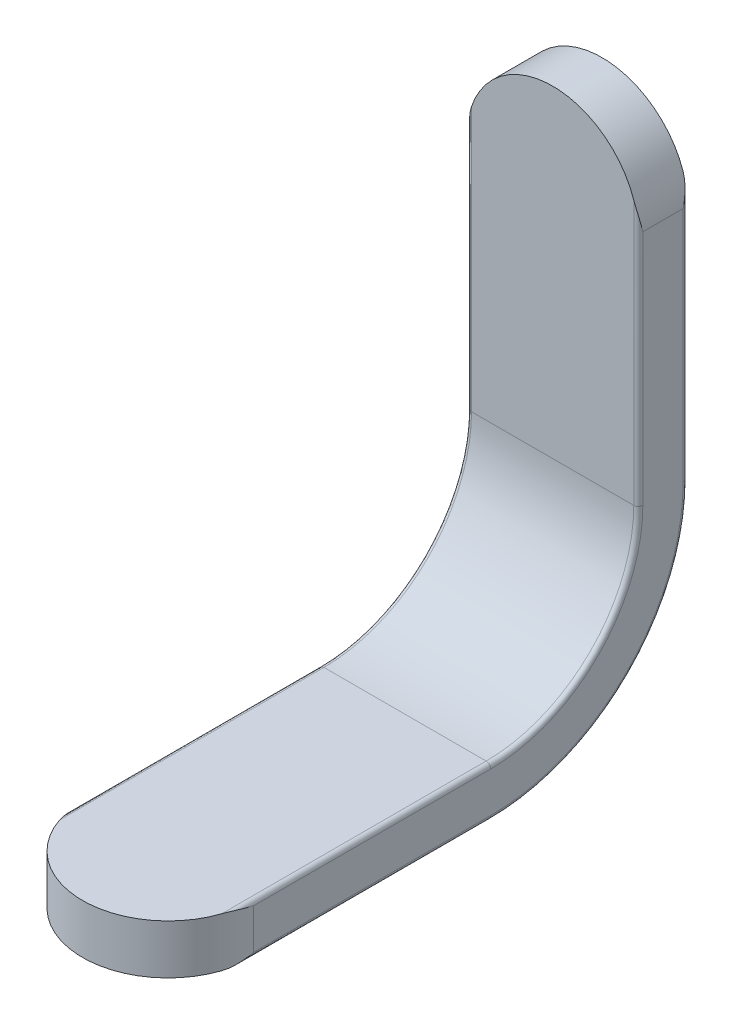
ISO-10303-21;
HEADER;
FILE_DESCRIPTION(('STEP AP214'),'2;1');
FILE_NAME('part.step','',(''),(''),'','','');
FILE_SCHEMA(('AUTOMOTIVE_DESIGN { 1 0 10303 214 1 1 1 1 }'));
ENDSEC;
DATA;
#1=APPLICATION_CONTEXT('core data for automotive mechanical design processes');
#2=APPLICATION_PROTOCOL_DEFINITION('international standard','automotive_design',2000,#1);
#3=PRODUCT_CONTEXT('',#1,'mechanical');
#4=PRODUCT('Part','Part','',(#3));
#5=PRODUCT_RELATED_PRODUCT_CATEGORY('part','',(#4));
#6=PRODUCT_DEFINITION_FORMATION('','',#4);
#7=PRODUCT_DEFINITION_CONTEXT('part definition',#1,'design');
#8=PRODUCT_DEFINITION('design','',#6,#7);
#9=PRODUCT_DEFINITION_SHAPE('','',#8);
#10=(LENGTH_UNIT() NAMED_UNIT(*) SI_UNIT(.MILLI.,.METRE.));
#11=(NAMED_UNIT(*) PLANE_ANGLE_UNIT() SI_UNIT($,.RADIAN.));
#12=(NAMED_UNIT(*) SI_UNIT($,.STERADIAN.) SOLID_ANGLE_UNIT());
#13=UNCERTAINTY_MEASURE_WITH_UNIT(LENGTH_MEASURE(1.E-05),#10,'distance_accuracy_value','');
#14=(GEOMETRIC_REPRESENTATION_CONTEXT(3) GLOBAL_UNCERTAINTY_ASSIGNED_CONTEXT((#13)) GLOBAL_UNIT_ASSIGNED_CONTEXT((#10,
#11,#12)) REPRESENTATION_CONTEXT('',''));
#15=CARTESIAN_POINT('',(0.,0.,0.));
#16=DIRECTION('',(0.,0.,1.));
#17=DIRECTION('',(1.,0.,0.));
#18=AXIS2_PLACEMENT_3D('',#15,#16,#17);
#19=CARTESIAN_POINT('',(0.,152.,0.));
#20=DIRECTION('',(0.,0.,1.));
#21=DIRECTION('',(1.,0.,0.));
#22=AXIS2_PLACEMENT_3D('',#19,#20,#21);
#23=CYLINDRICAL_SURFACE('',#22,30.);
#24=CARTESIAN_POINT('',(28.41,161.637006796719,17.3));
#25=CARTESIAN_POINT('',(28.4528668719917,161.510636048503,17.2999913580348));
#26=CARTESIAN_POINT('',(28.4948856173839,161.38399127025,17.2982675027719));
#27=CARTESIAN_POINT('',(28.5772027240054,161.130239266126,17.2917248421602));
#28=CARTESIAN_POINT('',(28.6175012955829,161.003132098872,17.2869064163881));
#29=CARTESIAN_POINT('',(28.7357392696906,160.621382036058,17.2683205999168));
#30=CARTESIAN_POINT('',(28.8110826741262,160.366128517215,17.2504216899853));
#31=CARTESIAN_POINT('',(28.9546638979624,159.854800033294,17.2056882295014));
#32=CARTESIAN_POINT('',(29.0229107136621,159.598726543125,17.1788651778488));
#33=CARTESIAN_POINT('',(29.1524241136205,159.085633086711,17.1178460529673));
#34=CARTESIAN_POINT('',(29.2136888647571,158.828612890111,17.0836480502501));
#35=CARTESIAN_POINT('',(29.3322213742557,158.300613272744,17.0072406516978));
#36=CARTESIAN_POINT('',(29.3891197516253,158.029597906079,16.9647089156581));
#37=CARTESIAN_POINT('',(29.4952454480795,157.486978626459,16.8741330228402));
#38=CARTESIAN_POINT('',(29.544472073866,157.21537466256,16.8260883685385));
#39=CARTESIAN_POINT('',(29.6807386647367,156.39973999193,16.6752512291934));
#40=CARTESIAN_POINT('',(29.7563413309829,155.854993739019,16.5657719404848));
#41=CARTESIAN_POINT('',(29.8774145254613,154.764308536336,16.335841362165));
#42=CARTESIAN_POINT('',(29.9228705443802,154.218369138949,16.2153848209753));
#43=CARTESIAN_POINT('',(29.9838407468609,153.126170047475,15.9692153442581));
#44=CARTESIAN_POINT('',(29.9993665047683,152.579910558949,15.8435044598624));
#45=CARTESIAN_POINT('',(29.9999936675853,152.022505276,15.7151811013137));
#46=CARTESIAN_POINT('',(29.9999999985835,152.011252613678,15.7125905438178));
#47=CARTESIAN_POINT('',(30.,152.,15.71));
#48=B_SPLINE_CURVE_WITH_KNOTS('',3,(#24,#25,#26,#27,#28,#29,#30,#31,#32,#33,#34,#35,#36,#37,#38,
#39,#40,#41,#42,#43,#44,#45,#46,#47),.UNSPECIFIED.,.F.,.F.,(4,2,2,2,2,2,2,2,2,2,2,4),(0.,
0.400295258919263,0.800541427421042,1.60045769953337,2.39934723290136,3.1984460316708,
4.03877949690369,4.87918885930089,6.56034026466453,8.24230020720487,9.92360958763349,
9.95825060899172),.UNSPECIFIED.);
#49=CARTESIAN_POINT('',(30.,152.,15.71));
#50=VERTEX_POINT('',#49);
#51=CARTESIAN_POINT('',(28.41,161.637006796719,17.3));
#52=VERTEX_POINT('',#51);
#53=EDGE_CURVE('E180',#50,#52,#48,.F.);
#54=ORIENTED_EDGE('',*,*,#53,.F.);
#55=DIRECTION('',(0.,0.,1.));
#56=VECTOR('',#55,1.);
#57=CARTESIAN_POINT('',(30.,152.,0.));
#58=LINE('',#57,#56);
#59=CARTESIAN_POINT('',(30.,152.,1.58999999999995));
#60=VERTEX_POINT('',#59);
#61=EDGE_CURVE('E353',#60,#50,#58,.T.);
#62=ORIENTED_EDGE('',*,*,#61,.F.);
#63=CARTESIAN_POINT('',(28.41,161.637006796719,0.));
#64=CARTESIAN_POINT('',(28.4528668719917,161.510636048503,8.64196513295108E-06));
#65=CARTESIAN_POINT('',(28.494885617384,161.38399127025,0.00173249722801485));
#66=CARTESIAN_POINT('',(28.5772027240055,161.130239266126,0.00827515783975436));
#67=CARTESIAN_POINT('',(28.617501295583,161.003132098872,0.0130935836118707));
#68=CARTESIAN_POINT('',(28.7357392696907,160.621382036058,0.0316794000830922));
#69=CARTESIAN_POINT('',(28.8110826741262,160.366128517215,0.0495783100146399));
#70=CARTESIAN_POINT('',(28.9546638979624,159.854800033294,0.0943117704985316));
#71=CARTESIAN_POINT('',(29.0229107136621,159.598726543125,0.121134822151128));
#72=CARTESIAN_POINT('',(29.1524241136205,159.08563308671,0.182153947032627));
#73=CARTESIAN_POINT('',(29.2136888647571,158.828612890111,0.2163519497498));
#74=CARTESIAN_POINT('',(29.3322213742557,158.300613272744,0.292759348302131));
#75=CARTESIAN_POINT('',(29.3891197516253,158.029597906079,0.33529108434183));
#76=CARTESIAN_POINT('',(29.4952454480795,157.486978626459,0.425866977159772));
#77=CARTESIAN_POINT('',(29.544472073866,157.21537466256,0.473911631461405));
#78=CARTESIAN_POINT('',(29.6807386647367,156.39973999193,0.624748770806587));
#79=CARTESIAN_POINT('',(29.7563413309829,155.854993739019,0.734228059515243));
#80=CARTESIAN_POINT('',(29.8774145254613,154.764308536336,0.964158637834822));
#81=CARTESIAN_POINT('',(29.9228705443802,154.218369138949,1.08461517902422));
#82=CARTESIAN_POINT('',(29.9838407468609,153.126170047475,1.33078465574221));
#83=CARTESIAN_POINT('',(29.9993665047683,152.57991055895,1.45649554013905));
#84=CARTESIAN_POINT('',(29.9999936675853,152.022505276,1.58481889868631));
#85=CARTESIAN_POINT('',(29.9999999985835,152.011252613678,1.58740945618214));
#86=CARTESIAN_POINT('',(30.,152.,1.58999999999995));
#87=B_SPLINE_CURVE_WITH_KNOTS('',3,(#63,#64,#65,#66,#67,#68,#69,#70,#71,#72,#73,#74,#75,#76,#77,
#78,#79,#80,#81,#82,#83,#84,#85,#86),.UNSPECIFIED.,.F.,.F.,(4,2,2,2,2,2,2,2,2,2,2,4),(0.,
0.400295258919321,0.800541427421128,1.60045769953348,2.39934723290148,3.1984460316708,
4.03877949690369,4.87918885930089,6.56034026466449,8.24230020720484,9.92360958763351,
9.95825060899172),.UNSPECIFIED.);
#88=CARTESIAN_POINT('',(28.41,161.637006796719,0.));
#89=VERTEX_POINT('',#88);
#90=EDGE_CURVE('E221',#89,#60,#87,.T.);
#91=ORIENTED_EDGE('',*,*,#90,.F.);
#92=CARTESIAN_POINT('',(0.,152.,0.));
#93=DIRECTION('',(0.,0.,-1.));
#94=DIRECTION('',(1.,0.,0.));
#95=AXIS2_PLACEMENT_3D('',#92,#93,#94);
#96=CIRCLE('',#95,30.);
#97=CARTESIAN_POINT('',(-28.41,161.637006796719,0.));
#98=VERTEX_POINT('',#97);
#99=EDGE_CURVE('E350',#98,#89,#96,.T.);
#100=ORIENTED_EDGE('',*,*,#99,.F.);
#101=CARTESIAN_POINT('',(-28.41,161.637006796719,0.));
#102=CARTESIAN_POINT('',(-28.4528668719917,161.510636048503,8.64196513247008E-06));
#103=CARTESIAN_POINT('',(-28.494885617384,161.38399127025,0.00173249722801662));
#104=CARTESIAN_POINT('',(-28.5772027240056,161.130239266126,0.00827515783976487));
#105=CARTESIAN_POINT('',(-28.6175012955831,161.003132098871,0.0130935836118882));
#106=CARTESIAN_POINT('',(-28.7357392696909,160.621382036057,0.0316794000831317));
#107=CARTESIAN_POINT('',(-28.8110826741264,160.366128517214,0.0495783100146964));
#108=CARTESIAN_POINT('',(-28.9546638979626,159.854800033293,0.0943117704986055));
#109=CARTESIAN_POINT('',(-29.0229107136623,159.598726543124,0.121134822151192));
#110=CARTESIAN_POINT('',(-29.1524241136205,159.08563308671,0.182153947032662));
#111=CARTESIAN_POINT('',(-29.2136888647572,158.828612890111,0.216351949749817));
#112=CARTESIAN_POINT('',(-29.3322213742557,158.300613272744,0.292759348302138));
#113=CARTESIAN_POINT('',(-29.3891197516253,158.029597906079,0.335291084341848));
#114=CARTESIAN_POINT('',(-29.4952454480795,157.486978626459,0.42586697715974));
#115=CARTESIAN_POINT('',(-29.544472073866,157.21537466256,0.47391163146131));
#116=CARTESIAN_POINT('',(-29.6807386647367,156.39973999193,0.624748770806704));
#117=CARTESIAN_POINT('',(-29.7563413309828,155.854993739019,0.734228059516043));
#118=CARTESIAN_POINT('',(-29.8774145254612,154.764308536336,0.964158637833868));
#119=CARTESIAN_POINT('',(-29.9228705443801,154.218369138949,1.08461517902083));
#120=CARTESIAN_POINT('',(-29.9838407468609,153.126170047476,1.33078465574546));
#121=CARTESIAN_POINT('',(-29.9993665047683,152.579910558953,1.45649554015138));
#122=CARTESIAN_POINT('',(-29.9999936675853,152.022505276,1.58481889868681));
#123=CARTESIAN_POINT('',(-29.9999999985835,152.011252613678,1.5874094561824));
#124=CARTESIAN_POINT('',(-30.,152.,1.58999999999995));
#125=B_SPLINE_CURVE_WITH_KNOTS('',3,(#101,#102,#103,#104,#105,#106,#107,#108,#109,#110,#111,
#112,#113,#114,#115,#116,#117,#118,#119,#120,#121,#122,#123,#124),.UNSPECIFIED.,.F.,.F.,(4,2,2,
2,2,2,2,2,2,2,2,4),(0.,0.400295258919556,0.800541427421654,1.60045769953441,2.39934723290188,
3.1984460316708,4.03877949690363,4.87918885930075,6.56034026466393,8.24230020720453,
9.92360958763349,9.95825060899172),.UNSPECIFIED.);
#126=CARTESIAN_POINT('',(-30.,152.,1.58999999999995));
#127=VERTEX_POINT('',#126);
#128=EDGE_CURVE('E213',#127,#98,#125,.F.);
#129=ORIENTED_EDGE('',*,*,#128,.F.);
#130=DIRECTION('',(0.,0.,1.));
#131=VECTOR('',#130,1.);
#132=CARTESIAN_POINT('',(-30.,152.,0.));
#133=LINE('',#132,#131);
#134=CARTESIAN_POINT('',(-30.,152.,15.71));
#135=VERTEX_POINT('',#134);
#136=EDGE_CURVE('E292',#127,#135,#133,.T.);
#137=ORIENTED_EDGE('',*,*,#136,.T.);
#138=CARTESIAN_POINT('',(-28.41,161.637006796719,17.3));
#139=CARTESIAN_POINT('',(-28.4528668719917,161.510636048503,17.2999913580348));
#140=CARTESIAN_POINT('',(-28.494885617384,161.38399127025,17.2982675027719));
#141=CARTESIAN_POINT('',(-28.5772027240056,161.130239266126,17.2917248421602));
#142=CARTESIAN_POINT('',(-28.6175012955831,161.003132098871,17.286906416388));
#143=CARTESIAN_POINT('',(-28.7357392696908,160.621382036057,17.2683205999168));
#144=CARTESIAN_POINT('',(-28.8110826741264,160.366128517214,17.2504216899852));
#145=CARTESIAN_POINT('',(-28.9546638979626,159.854800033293,17.2056882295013));
#146=CARTESIAN_POINT('',(-29.0229107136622,159.598726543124,17.1788651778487));
#147=CARTESIAN_POINT('',(-29.1524241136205,159.08563308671,17.1178460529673));
#148=CARTESIAN_POINT('',(-29.2136888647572,158.828612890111,17.0836480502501));
#149=CARTESIAN_POINT('',(-29.3322213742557,158.300613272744,17.0072406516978));
#150=CARTESIAN_POINT('',(-29.3891197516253,158.029597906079,16.9647089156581));
#151=CARTESIAN_POINT('',(-29.4952454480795,157.486978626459,16.8741330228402));
#152=CARTESIAN_POINT('',(-29.544472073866,157.21537466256,16.8260883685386));
#153=CARTESIAN_POINT('',(-29.6807386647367,156.39973999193,16.6752512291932));
#154=CARTESIAN_POINT('',(-29.7563413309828,155.854993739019,16.565771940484));
#155=CARTESIAN_POINT('',(-29.8774145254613,154.764308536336,16.3358413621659));
#156=CARTESIAN_POINT('',(-29.9228705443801,154.218369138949,16.2153848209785));
#157=CARTESIAN_POINT('',(-29.9838407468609,153.126170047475,15.969215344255));
#158=CARTESIAN_POINT('',(-29.9993665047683,152.579910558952,15.8435044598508));
#159=CARTESIAN_POINT('',(-29.9999936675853,152.022505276,15.7151811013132));
#160=CARTESIAN_POINT('',(-29.9999999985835,152.011252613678,15.7125905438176));
#161=CARTESIAN_POINT('',(-30.,152.,15.71));
#162=B_SPLINE_CURVE_WITH_KNOTS('',3,(#138,#139,#140,#141,#142,#143,#144,#145,#146,#147,#148,
#149,#150,#151,#152,#153,#154,#155,#156,#157,#158,#159,#160,#161),.UNSPECIFIED.,.F.,.F.,(4,2,2,
2,2,2,2,2,2,2,2,4),(0.,0.400295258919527,0.800541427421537,1.60045769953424,2.39934723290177,
3.19844603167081,4.03877949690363,4.87918885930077,6.56034026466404,8.24230020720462,
9.92360958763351,9.95825060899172),.UNSPECIFIED.);
#163=CARTESIAN_POINT('',(-28.41,161.637006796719,17.3));
#164=VERTEX_POINT('',#163);
#165=EDGE_CURVE('E205',#164,#135,#162,.T.);
#166=ORIENTED_EDGE('',*,*,#165,.F.);
#167=CARTESIAN_POINT('',(0.,152.,17.3));
#168=DIRECTION('',(0.,0.,-1.));
#169=DIRECTION('',(1.,0.,0.));
#170=AXIS2_PLACEMENT_3D('',#167,#168,#169);
#171=CIRCLE('',#170,30.);
#172=EDGE_CURVE('E347',#164,#52,#171,.T.);
#173=ORIENTED_EDGE('',*,*,#172,.T.);
#174=EDGE_LOOP('',(#54,#62,#91,#100,#129,#137,#166,#173));
#175=FACE_BOUND('',#174,.T.);
#176=ADVANCED_FACE('F33',(#175),#23,.T.);
#177=CARTESIAN_POINT('',(30.,69.,69.));
#178=DIRECTION('',(-1.,0.,0.));
#179=DIRECTION('',(0.,0.,1.));
#180=AXIS2_PLACEMENT_3D('',#177,#178,#179);
#181=PLANE('',#180);
#182=DIRECTION('',(0.,1.,0.));
#183=VECTOR('',#182,1.);
#184=CARTESIAN_POINT('',(30.,69.,15.71));
#185=LINE('',#184,#183);
#186=CARTESIAN_POINT('',(30.,69.,15.71));
#187=VERTEX_POINT('',#186);
#188=EDGE_CURVE('E170',#187,#50,#185,.T.);
#189=ORIENTED_EDGE('',*,*,#188,.F.);
#190=CARTESIAN_POINT('',(30.,69.,69.));
#191=DIRECTION('',(1.,0.,0.));
#192=DIRECTION('',(0.,0.,-1.));
#193=AXIS2_PLACEMENT_3D('',#190,#191,#192);
#194=CIRCLE('',#193,53.29);
#195=CARTESIAN_POINT('',(30.,15.71,69.));
#196=VERTEX_POINT('',#195);
#197=EDGE_CURVE('E163',#196,#187,#194,.T.);
#198=ORIENTED_EDGE('',*,*,#197,.F.);
#199=DIRECTION('',(0.,0.,1.));
#200=VECTOR('',#199,1.);
#201=CARTESIAN_POINT('',(30.,15.71,69.));
#202=LINE('',#201,#200);
#203=CARTESIAN_POINT('',(30.,15.71,152.));
#204=VERTEX_POINT('',#203);
#205=EDGE_CURVE('E150',#196,#204,#202,.T.);
#206=ORIENTED_EDGE('',*,*,#205,.T.);
#207=DIRECTION('',(0.,1.,0.));
#208=VECTOR('',#207,1.);
#209=CARTESIAN_POINT('',(30.,0.,152.));
#210=LINE('',#209,#208);
#211=CARTESIAN_POINT('',(30.,1.58999999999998,152.));
#212=VERTEX_POINT('',#211);
#213=EDGE_CURVE('E345',#212,#204,#210,.T.);
#214=ORIENTED_EDGE('',*,*,#213,.F.);
#215=DIRECTION('',(0.,0.,1.));
#216=VECTOR('',#215,1.);
#217=CARTESIAN_POINT('',(30.,1.58999999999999,69.));
#218=LINE('',#217,#216);
#219=CARTESIAN_POINT('',(30.,1.58999999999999,69.));
#220=VERTEX_POINT('',#219);
#221=EDGE_CURVE('E60',#220,#212,#218,.T.);
#222=ORIENTED_EDGE('',*,*,#221,.F.);
#223=CARTESIAN_POINT('',(30.,69.,69.));
#224=DIRECTION('',(1.,0.,0.));
#225=DIRECTION('',(0.,0.,-1.));
#226=AXIS2_PLACEMENT_3D('',#223,#224,#225);
#227=CIRCLE('',#226,67.41);
#228=CARTESIAN_POINT('',(30.,69.,1.58999999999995));
#229=VERTEX_POINT('',#228);
#230=EDGE_CURVE('E274',#220,#229,#227,.T.);
#231=ORIENTED_EDGE('',*,*,#230,.T.);
#232=DIRECTION('',(0.,1.,0.));
#233=VECTOR('',#232,1.);
#234=CARTESIAN_POINT('',(30.,69.,1.58999999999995));
#235=LINE('',#234,#233);
#236=EDGE_CURVE('E229',#229,#60,#235,.T.);
#237=ORIENTED_EDGE('',*,*,#236,.T.);
#238=ORIENTED_EDGE('',*,*,#61,.T.);
#239=EDGE_LOOP('',(#189,#198,#206,#214,#222,#231,#237,#238));
#240=FACE_BOUND('',#239,.T.);
#241=ADVANCED_FACE('F168',(#240),#181,.F.);
#242=CARTESIAN_POINT('',(30.,69.,69.));
#243=DIRECTION('',(-1.,0.,0.));
#244=DIRECTION('',(0.,0.,1.));
#245=AXIS2_PLACEMENT_3D('',#242,#243,#244);
#246=CYLINDRICAL_SURFACE('',#245,51.7);
#247=CARTESIAN_POINT('',(28.41,69.,69.));
#248=DIRECTION('',(1.,0.,0.));
#249=DIRECTION('',(0.,0.,-1.));
#250=AXIS2_PLACEMENT_3D('',#247,#248,#249);
#251=CIRCLE('',#250,51.7);
#252=CARTESIAN_POINT('',(28.41,17.3,69.));
#253=VERTEX_POINT('',#252);
#254=CARTESIAN_POINT('',(28.41,69.,17.3));
#255=VERTEX_POINT('',#254);
#256=EDGE_CURVE('E166',#253,#255,#251,.T.);
#257=ORIENTED_EDGE('',*,*,#256,.T.);
#258=DIRECTION('',(-1.,0.,0.));
#259=VECTOR('',#258,1.);
#260=CARTESIAN_POINT('',(30.,69.,17.3));
#261=LINE('',#260,#259);
#262=CARTESIAN_POINT('',(-28.41,69.,17.3));
#263=VERTEX_POINT('',#262);
#264=EDGE_CURVE('E290',#255,#263,#261,.T.);
#265=ORIENTED_EDGE('',*,*,#264,.T.);
#266=CARTESIAN_POINT('',(-28.41,69.,69.));
#267=DIRECTION('',(1.,0.,0.));
#268=DIRECTION('',(0.,0.,-1.));
#269=AXIS2_PLACEMENT_3D('',#266,#267,#268);
#270=CIRCLE('',#269,51.7);
#271=CARTESIAN_POINT('',(-28.41,17.3,69.));
#272=VERTEX_POINT('',#271);
#273=EDGE_CURVE('E367',#272,#263,#270,.T.);
#274=ORIENTED_EDGE('',*,*,#273,.F.);
#275=DIRECTION('',(-1.,0.,0.));
#276=VECTOR('',#275,1.);
#277=CARTESIAN_POINT('',(30.,17.3,69.));
#278=LINE('',#277,#276);
#279=EDGE_CURVE('E288',#253,#272,#278,.T.);
#280=ORIENTED_EDGE('',*,*,#279,.F.);
#281=EDGE_LOOP('',(#257,#265,#274,#280));
#282=FACE_BOUND('',#281,.T.);
#283=ADVANCED_FACE('F364',(#282),#246,.F.);
#284=CARTESIAN_POINT('',(30.,0.,69.));
#285=DIRECTION('',(0.,1.,0.));
#286=DIRECTION('',(0.,0.,1.));
#287=AXIS2_PLACEMENT_3D('',#284,#285,#286);
#288=PLANE('',#287);
#289=DIRECTION('',(0.,0.,1.));
#290=VECTOR('',#289,1.);
#291=CARTESIAN_POINT('',(28.41,0.,69.));
#292=LINE('',#291,#290);
#293=CARTESIAN_POINT('',(28.41,0.,69.));
#294=VERTEX_POINT('',#293);
#295=CARTESIAN_POINT('',(28.41,0.,161.637006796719));
#296=VERTEX_POINT('',#295);
#297=EDGE_CURVE('E262',#294,#296,#292,.T.);
#298=ORIENTED_EDGE('',*,*,#297,.T.);
#299=CARTESIAN_POINT('',(0.,0.,152.));
#300=DIRECTION('',(0.,1.,0.));
#301=DIRECTION('',(0.,0.,1.));
#302=AXIS2_PLACEMENT_3D('',#299,#300,#301);
#303=CIRCLE('',#302,30.);
#304=CARTESIAN_POINT('',(-28.41,0.,161.637006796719));
#305=VERTEX_POINT('',#304);
#306=EDGE_CURVE('E297',#296,#305,#303,.F.);
#307=ORIENTED_EDGE('',*,*,#306,.T.);
#308=DIRECTION('',(0.,0.,1.));
#309=VECTOR('',#308,1.);
#310=CARTESIAN_POINT('',(-28.41,0.,69.));
#311=LINE('',#310,#309);
#312=CARTESIAN_POINT('',(-28.41,0.,69.));
#313=VERTEX_POINT('',#312);
#314=EDGE_CURVE('E287',#313,#305,#311,.T.);
#315=ORIENTED_EDGE('',*,*,#314,.F.);
#316=DIRECTION('',(-1.,0.,0.));
#317=VECTOR('',#316,1.);
#318=CARTESIAN_POINT('',(30.,0.,69.));
#319=LINE('',#318,#317);
#320=EDGE_CURVE('E279',#294,#313,#319,.T.);
#321=ORIENTED_EDGE('',*,*,#320,.F.);
#322=EDGE_LOOP('',(#298,#307,#315,#321));
#323=FACE_BOUND('',#322,.T.);
#324=ADVANCED_FACE('F285',(#323),#288,.F.);
#325=CARTESIAN_POINT('',(30.,69.,69.));
#326=DIRECTION('',(-1.,0.,0.));
#327=DIRECTION('',(0.,0.,1.));
#328=AXIS2_PLACEMENT_3D('',#325,#326,#327);
#329=CYLINDRICAL_SURFACE('',#328,69.);
#330=CARTESIAN_POINT('',(28.41,69.,69.));
#331=DIRECTION('',(1.,0.,0.));
#332=DIRECTION('',(0.,0.,-1.));
#333=AXIS2_PLACEMENT_3D('',#330,#331,#332);
#334=CIRCLE('',#333,69.);
#335=CARTESIAN_POINT('',(28.41,69.,0.));
#336=VERTEX_POINT('',#335);
#337=EDGE_CURVE('E271',#294,#336,#334,.T.);
#338=ORIENTED_EDGE('',*,*,#337,.F.);
#339=ORIENTED_EDGE('',*,*,#320,.T.);
#340=CARTESIAN_POINT('',(-28.41,69.,69.));
#341=DIRECTION('',(1.,0.,0.));
#342=DIRECTION('',(0.,0.,-1.));
#343=AXIS2_PLACEMENT_3D('',#340,#341,#342);
#344=CIRCLE('',#343,69.);
#345=CARTESIAN_POINT('',(-28.41,69.,0.));
#346=VERTEX_POINT('',#345);
#347=EDGE_CURVE('E387',#313,#346,#344,.T.);
#348=ORIENTED_EDGE('',*,*,#347,.T.);
#349=DIRECTION('',(-1.,0.,0.));
#350=VECTOR('',#349,1.);
#351=CARTESIAN_POINT('',(30.,69.,0.));
#352=LINE('',#351,#350);
#353=EDGE_CURVE('E281',#336,#346,#352,.T.);
#354=ORIENTED_EDGE('',*,*,#353,.F.);
#355=EDGE_LOOP('',(#338,#339,#348,#354));
#356=FACE_BOUND('',#355,.T.);
#357=ADVANCED_FACE('F277',(#356),#329,.T.);
#358=CARTESIAN_POINT('',(30.,182.,0.));
#359=DIRECTION('',(0.,0.,1.));
#360=DIRECTION('',(0.,-1.,0.));
#361=AXIS2_PLACEMENT_3D('',#358,#359,#360);
#362=PLANE('',#361);
#363=DIRECTION('',(0.,1.,0.));
#364=VECTOR('',#363,1.);
#365=CARTESIAN_POINT('',(28.41,69.,0.));
#366=LINE('',#365,#364);
#367=EDGE_CURVE('E409',#336,#89,#366,.T.);
#368=ORIENTED_EDGE('',*,*,#367,.F.);
#369=ORIENTED_EDGE('',*,*,#353,.T.);
#370=DIRECTION('',(0.,1.,0.));
#371=VECTOR('',#370,1.);
#372=CARTESIAN_POINT('',(-28.41,69.,0.));
#373=LINE('',#372,#371);
#374=EDGE_CURVE('E380',#346,#98,#373,.T.);
#375=ORIENTED_EDGE('',*,*,#374,.T.);
#376=ORIENTED_EDGE('',*,*,#99,.T.);
#377=EDGE_LOOP('',(#368,#369,#375,#376));
#378=FACE_BOUND('',#377,.T.);
#379=ADVANCED_FACE('F410',(#378),#362,.F.);
#380=CARTESIAN_POINT('',(-30.,69.,69.));
#381=DIRECTION('',(-1.,0.,0.));
#382=DIRECTION('',(0.,0.,1.));
#383=AXIS2_PLACEMENT_3D('',#380,#381,#382);
#384=PLANE('',#383);
#385=DIRECTION('',(0.,1.,0.));
#386=VECTOR('',#385,1.);
#387=CARTESIAN_POINT('',(-30.,69.,1.58999999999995));
#388=LINE('',#387,#386);
#389=CARTESIAN_POINT('',(-30.,69.,1.58999999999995));
#390=VERTEX_POINT('',#389);
#391=EDGE_CURVE('E385',#390,#127,#388,.T.);
#392=ORIENTED_EDGE('',*,*,#391,.F.);
#393=CARTESIAN_POINT('',(-30.,69.,69.));
#394=DIRECTION('',(1.,0.,0.));
#395=DIRECTION('',(0.,0.,-1.));
#396=AXIS2_PLACEMENT_3D('',#393,#394,#395);
#397=CIRCLE('',#396,67.41);
#398=CARTESIAN_POINT('',(-30.,1.58999999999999,69.));
#399=VERTEX_POINT('',#398);
#400=EDGE_CURVE('E391',#399,#390,#397,.T.);
#401=ORIENTED_EDGE('',*,*,#400,.F.);
#402=DIRECTION('',(0.,0.,1.));
#403=VECTOR('',#402,1.);
#404=CARTESIAN_POINT('',(-30.,1.58999999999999,69.));
#405=LINE('',#404,#403);
#406=CARTESIAN_POINT('',(-30.,1.58999999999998,152.));
#407=VERTEX_POINT('',#406);
#408=EDGE_CURVE('E396',#399,#407,#405,.T.);
#409=ORIENTED_EDGE('',*,*,#408,.T.);
#410=DIRECTION('',(0.,1.,0.));
#411=VECTOR('',#410,1.);
#412=CARTESIAN_POINT('',(-30.,0.,152.));
#413=LINE('',#412,#411);
#414=CARTESIAN_POINT('',(-30.,15.71,152.));
#415=VERTEX_POINT('',#414);
#416=EDGE_CURVE('E340',#407,#415,#413,.T.);
#417=ORIENTED_EDGE('',*,*,#416,.T.);
#418=DIRECTION('',(0.,0.,1.));
#419=VECTOR('',#418,1.);
#420=CARTESIAN_POINT('',(-30.,15.71,69.));
#421=LINE('',#420,#419);
#422=CARTESIAN_POINT('',(-30.,15.71,69.));
#423=VERTEX_POINT('',#422);
#424=EDGE_CURVE('E369',#423,#415,#421,.T.);
#425=ORIENTED_EDGE('',*,*,#424,.F.);
#426=CARTESIAN_POINT('',(-30.,69.,69.));
#427=DIRECTION('',(1.,0.,0.));
#428=DIRECTION('',(0.,0.,-1.));
#429=AXIS2_PLACEMENT_3D('',#426,#427,#428);
#430=CIRCLE('',#429,53.29);
#431=CARTESIAN_POINT('',(-30.,69.,15.71));
#432=VERTEX_POINT('',#431);
#433=EDGE_CURVE('E337',#423,#432,#430,.T.);
#434=ORIENTED_EDGE('',*,*,#433,.T.);
#435=DIRECTION('',(0.,1.,0.));
#436=VECTOR('',#435,1.);
#437=CARTESIAN_POINT('',(-30.,69.,15.71));
#438=LINE('',#437,#436);
#439=EDGE_CURVE('E326',#432,#135,#438,.T.);
#440=ORIENTED_EDGE('',*,*,#439,.T.);
#441=ORIENTED_EDGE('',*,*,#136,.F.);
#442=EDGE_LOOP('',(#392,#401,#409,#417,#425,#434,#440,#441));
#443=FACE_BOUND('',#442,.T.);
#444=ADVANCED_FACE('F200',(#443),#384,.T.);
#445=CARTESIAN_POINT('',(30.,182.,17.3));
#446=DIRECTION('',(0.,0.,-1.));
#447=DIRECTION('',(0.,1.,0.));
#448=AXIS2_PLACEMENT_3D('',#445,#446,#447);
#449=PLANE('',#448);
#450=ORIENTED_EDGE('',*,*,#264,.F.);
#451=DIRECTION('',(0.,1.,0.));
#452=VECTOR('',#451,1.);
#453=CARTESIAN_POINT('',(28.41,69.,17.3));
#454=LINE('',#453,#452);
#455=EDGE_CURVE('E177',#255,#52,#454,.T.);
#456=ORIENTED_EDGE('',*,*,#455,.T.);
#457=ORIENTED_EDGE('',*,*,#172,.F.);
#458=DIRECTION('',(0.,1.,0.));
#459=VECTOR('',#458,1.);
#460=CARTESIAN_POINT('',(-28.41,69.,17.3));
#461=LINE('',#460,#459);
#462=EDGE_CURVE('E329',#263,#164,#461,.T.);
#463=ORIENTED_EDGE('',*,*,#462,.F.);
#464=EDGE_LOOP('',(#450,#456,#457,#463));
#465=FACE_BOUND('',#464,.T.);
#466=ADVANCED_FACE('F35',(#465),#449,.F.);
#467=CARTESIAN_POINT('',(30.,17.3,69.));
#468=DIRECTION('',(0.,-1.,0.));
#469=DIRECTION('',(0.,0.,-1.));
#470=AXIS2_PLACEMENT_3D('',#467,#468,#469);
#471=PLANE('',#470);
#472=CARTESIAN_POINT('',(0.,17.3,152.));
#473=DIRECTION('',(0.,-1.,0.));
#474=DIRECTION('',(0.,0.,1.));
#475=AXIS2_PLACEMENT_3D('',#472,#473,#474);
#476=CIRCLE('',#475,30.);
#477=CARTESIAN_POINT('',(28.41,17.3,161.637006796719));
#478=VERTEX_POINT('',#477);
#479=CARTESIAN_POINT('',(-28.41,17.3,161.637006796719));
#480=VERTEX_POINT('',#479);
#481=EDGE_CURVE('E338',#478,#480,#476,.T.);
#482=ORIENTED_EDGE('',*,*,#481,.F.);
#483=DIRECTION('',(0.,0.,1.));
#484=VECTOR('',#483,1.);
#485=CARTESIAN_POINT('',(28.41,17.3,69.));
#486=LINE('',#485,#484);
#487=EDGE_CURVE('E53',#253,#478,#486,.T.);
#488=ORIENTED_EDGE('',*,*,#487,.F.);
#489=ORIENTED_EDGE('',*,*,#279,.T.);
#490=DIRECTION('',(0.,0.,1.));
#491=VECTOR('',#490,1.);
#492=CARTESIAN_POINT('',(-28.41,17.3,69.));
#493=LINE('',#492,#491);
#494=EDGE_CURVE('E376',#272,#480,#493,.T.);
#495=ORIENTED_EDGE('',*,*,#494,.T.);
#496=EDGE_LOOP('',(#482,#488,#489,#495));
#497=FACE_BOUND('',#496,.T.);
#498=ADVANCED_FACE('F320',(#497),#471,.F.);
#499=CARTESIAN_POINT('',(0.,0.,152.));
#500=DIRECTION('',(0.,1.,0.));
#501=DIRECTION('',(0.,0.,1.));
#502=AXIS2_PLACEMENT_3D('',#499,#500,#501);
#503=CYLINDRICAL_SURFACE('',#502,30.);
#504=ORIENTED_EDGE('',*,*,#213,.T.);
#505=CARTESIAN_POINT('',(28.41,17.3,161.637006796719));
#506=CARTESIAN_POINT('',(28.4528668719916,17.2999913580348,161.510636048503));
#507=CARTESIAN_POINT('',(28.4948856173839,17.2982675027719,161.383991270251));
#508=CARTESIAN_POINT('',(28.5772027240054,17.2917248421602,161.130239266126));
#509=CARTESIAN_POINT('',(28.6175012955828,17.2869064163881,161.003132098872));
#510=CARTESIAN_POINT('',(28.7357392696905,17.2683205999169,160.621382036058));
#511=CARTESIAN_POINT('',(28.811082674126,17.2504216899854,160.366128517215));
#512=CARTESIAN_POINT('',(28.9546638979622,17.2056882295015,159.854800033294));
#513=CARTESIAN_POINT('',(29.022910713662,17.1788651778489,159.598726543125));
#514=CARTESIAN_POINT('',(29.1524241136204,17.1178460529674,159.085633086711));
#515=CARTESIAN_POINT('',(29.2136888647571,17.0836480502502,158.828612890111));
#516=CARTESIAN_POINT('',(29.3322213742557,17.0072406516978,158.300613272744));
#517=CARTESIAN_POINT('',(29.3891197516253,16.9647089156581,158.029597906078));
#518=CARTESIAN_POINT('',(29.4952454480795,16.8741330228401,157.486978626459));
#519=CARTESIAN_POINT('',(29.544472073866,16.8260883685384,157.21537466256));
#520=CARTESIAN_POINT('',(29.6807386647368,16.6752512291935,156.39973999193));
#521=CARTESIAN_POINT('',(29.7563413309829,16.5657719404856,155.854993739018));
#522=CARTESIAN_POINT('',(29.8774145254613,16.3358413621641,154.764308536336));
#523=CARTESIAN_POINT('',(29.9228705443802,16.2153848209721,154.218369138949));
#524=CARTESIAN_POINT('',(29.9838407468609,15.9692153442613,153.126170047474));
#525=CARTESIAN_POINT('',(29.9993665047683,15.8435044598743,152.579910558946));
#526=CARTESIAN_POINT('',(29.9999936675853,15.7151811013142,152.022505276));
#527=CARTESIAN_POINT('',(29.9999999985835,15.7125905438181,152.011252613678));
#528=CARTESIAN_POINT('',(30.,15.71,152.));
#529=B_SPLINE_CURVE_WITH_KNOTS('',3,(#505,#506,#507,#508,#509,#510,#511,#512,#513,#514,#515,
#516,#517,#518,#519,#520,#521,#522,#523,#524,#525,#526,#527,#528),.UNSPECIFIED.,.F.,.F.,(4,2,2,
2,2,2,2,2,2,2,2,4),(0.,0.400295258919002,0.800541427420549,1.60045769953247,2.39934723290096,
3.19844603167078,4.03877949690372,4.879188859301,6.56034026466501,8.24230020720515,
9.92360958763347,9.9582506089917),.UNSPECIFIED.);
#530=EDGE_CURVE('E11',#204,#478,#529,.F.);
#531=ORIENTED_EDGE('',*,*,#530,.T.);
#532=ORIENTED_EDGE('',*,*,#481,.T.);
#533=CARTESIAN_POINT('',(-28.41,17.3,161.637006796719));
#534=CARTESIAN_POINT('',(-28.4528668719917,17.2999913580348,161.510636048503));
#535=CARTESIAN_POINT('',(-28.494885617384,17.2982675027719,161.38399127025));
#536=CARTESIAN_POINT('',(-28.5772027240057,17.2917248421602,161.130239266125));
#537=CARTESIAN_POINT('',(-28.6175012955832,17.286906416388,161.003132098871));
#538=CARTESIAN_POINT('',(-28.735739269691,17.2683205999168,160.621382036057));
#539=CARTESIAN_POINT('',(-28.8110826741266,17.2504216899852,160.366128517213));
#540=CARTESIAN_POINT('',(-28.9546638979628,17.2056882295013,159.854800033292));
#541=CARTESIAN_POINT('',(-29.0229107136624,17.1788651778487,159.598726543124));
#542=CARTESIAN_POINT('',(-29.1524241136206,17.1178460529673,159.08563308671));
#543=CARTESIAN_POINT('',(-29.2136888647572,17.0836480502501,158.82861289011));
#544=CARTESIAN_POINT('',(-29.3322213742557,17.0072406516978,158.300613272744));
#545=CARTESIAN_POINT('',(-29.3891197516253,16.9647089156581,158.029597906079));
#546=CARTESIAN_POINT('',(-29.4952454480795,16.8741330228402,157.486978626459));
#547=CARTESIAN_POINT('',(-29.5444720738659,16.8260883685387,157.21537466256));
#548=CARTESIAN_POINT('',(-29.6807386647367,16.6752512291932,156.399739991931));
#549=CARTESIAN_POINT('',(-29.7563413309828,16.5657719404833,155.85499373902));
#550=CARTESIAN_POINT('',(-29.8774145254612,16.3358413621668,154.764308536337));
#551=CARTESIAN_POINT('',(-29.9228705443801,16.2153848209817,154.218369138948));
#552=CARTESIAN_POINT('',(-29.9838407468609,15.9692153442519,153.126170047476));
#553=CARTESIAN_POINT('',(-29.9993665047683,15.8435044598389,152.579910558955));
#554=CARTESIAN_POINT('',(-29.9999936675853,15.7151811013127,152.022505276));
#555=CARTESIAN_POINT('',(-29.9999999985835,15.7125905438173,152.011252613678));
#556=CARTESIAN_POINT('',(-30.,15.71,152.));
#557=B_SPLINE_CURVE_WITH_KNOTS('',3,(#533,#534,#535,#536,#537,#538,#539,#540,#541,#542,#543,
#544,#545,#546,#547,#548,#549,#550,#551,#552,#553,#554,#555,#556),.UNSPECIFIED.,.F.,.F.,(4,2,2,
2,2,2,2,2,2,2,2,4),(0.,0.400295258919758,0.800541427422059,1.60045769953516,2.39934723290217,
3.1984460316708,4.03877949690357,4.87918885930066,6.56034026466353,8.24230020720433,
9.92360958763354,9.95825060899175),.UNSPECIFIED.);
#558=EDGE_CURVE('E298',#480,#415,#557,.T.);
#559=ORIENTED_EDGE('',*,*,#558,.T.);
#560=ORIENTED_EDGE('',*,*,#416,.F.);
#561=CARTESIAN_POINT('',(-28.41,0.,161.637006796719));
#562=CARTESIAN_POINT('',(-28.4528668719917,8.64196515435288E-06,161.510636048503));
#563=CARTESIAN_POINT('',(-28.494885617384,0.00173249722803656,161.38399127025));
#564=CARTESIAN_POINT('',(-28.5772027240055,0.0082751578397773,161.130239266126));
#565=CARTESIAN_POINT('',(-28.617501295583,0.0130935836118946,161.003132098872));
#566=CARTESIAN_POINT('',(-28.7357392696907,0.031679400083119,160.621382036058));
#567=CARTESIAN_POINT('',(-28.8110826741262,0.0495783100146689,160.366128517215));
#568=CARTESIAN_POINT('',(-28.9546638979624,0.0943117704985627,159.854800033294));
#569=CARTESIAN_POINT('',(-29.0229107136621,0.121134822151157,159.598726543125));
#570=CARTESIAN_POINT('',(-29.1524241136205,0.182153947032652,159.08563308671));
#571=CARTESIAN_POINT('',(-29.2136888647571,0.216351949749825,158.828612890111));
#572=CARTESIAN_POINT('',(-29.3322213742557,0.292759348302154,158.300613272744));
#573=CARTESIAN_POINT('',(-29.3891197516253,0.335291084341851,158.029597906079));
#574=CARTESIAN_POINT('',(-29.4952454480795,0.425866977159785,157.486978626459));
#575=CARTESIAN_POINT('',(-29.544472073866,0.473911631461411,157.21537466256));
#576=CARTESIAN_POINT('',(-29.6807386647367,0.624748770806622,156.39973999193));
#577=CARTESIAN_POINT('',(-29.7563413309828,0.734228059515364,155.854993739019));
#578=CARTESIAN_POINT('',(-29.8774145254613,0.964158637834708,154.764308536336));
#579=CARTESIAN_POINT('',(-29.9228705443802,1.08461517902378,154.218369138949));
#580=CARTESIAN_POINT('',(-29.9838407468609,1.33078465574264,153.126170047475));
#581=CARTESIAN_POINT('',(-29.9993665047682,1.45649554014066,152.57991055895));
#582=CARTESIAN_POINT('',(-29.9999936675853,1.58481889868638,152.022505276));
#583=CARTESIAN_POINT('',(-29.9999999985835,1.58740945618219,152.011252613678));
#584=CARTESIAN_POINT('',(-30.,1.58999999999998,152.));
#585=B_SPLINE_CURVE_WITH_KNOTS('',3,(#561,#562,#563,#564,#565,#566,#567,#568,#569,#570,#571,
#572,#573,#574,#575,#576,#577,#578,#579,#580,#581,#582,#583,#584),.UNSPECIFIED.,.F.,.F.,(4,2,2,
2,2,2,2,2,2,2,2,4),(0.,0.40029525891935,0.800541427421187,1.60045769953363,2.39934723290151,
3.1984460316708,4.03877949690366,4.87918885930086,6.56034026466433,8.24230020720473,
9.92360958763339,9.95825060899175),.UNSPECIFIED.);
#586=EDGE_CURVE('E247',#407,#305,#585,.F.);
#587=ORIENTED_EDGE('',*,*,#586,.T.);
#588=ORIENTED_EDGE('',*,*,#306,.F.);
#589=CARTESIAN_POINT('',(28.41,0.,161.637006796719));
#590=CARTESIAN_POINT('',(28.4528668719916,8.64196515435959E-06,161.510636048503));
#591=CARTESIAN_POINT('',(28.4948856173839,0.00173249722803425,161.38399127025));
#592=CARTESIAN_POINT('',(28.5772027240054,0.00827515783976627,161.130239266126));
#593=CARTESIAN_POINT('',(28.6175012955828,0.0130935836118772,161.003132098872));
#594=CARTESIAN_POINT('',(28.7357392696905,0.0316794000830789,160.621382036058));
#595=CARTESIAN_POINT('',(28.811082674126,0.0495783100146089,160.366128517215));
#596=CARTESIAN_POINT('',(28.9546638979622,0.0943117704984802,159.854800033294));
#597=CARTESIAN_POINT('',(29.022910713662,0.121134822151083,159.598726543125));
#598=CARTESIAN_POINT('',(29.1524241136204,0.182153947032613,159.085633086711));
#599=CARTESIAN_POINT('',(29.2136888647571,0.21635194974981,158.828612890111));
#600=CARTESIAN_POINT('',(29.3322213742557,0.292759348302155,158.300613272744));
#601=CARTESIAN_POINT('',(29.3891197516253,0.335291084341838,158.029597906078));
#602=CARTESIAN_POINT('',(29.4952454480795,0.425866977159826,157.486978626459));
#603=CARTESIAN_POINT('',(29.544472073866,0.473911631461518,157.215374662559));
#604=CARTESIAN_POINT('',(29.6807386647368,0.624748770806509,156.39973999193));
#605=CARTESIAN_POINT('',(29.7563413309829,0.734228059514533,155.854993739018));
#606=CARTESIAN_POINT('',(29.8774145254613,0.964158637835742,154.764308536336));
#607=CARTESIAN_POINT('',(29.9228705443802,1.0846151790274,154.218369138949));
#608=CARTESIAN_POINT('',(29.9838407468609,1.33078465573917,153.126170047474));
#609=CARTESIAN_POINT('',(29.9993665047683,1.45649554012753,152.579910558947));
#610=CARTESIAN_POINT('',(29.9999936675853,1.58481889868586,152.022505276));
#611=CARTESIAN_POINT('',(29.9999999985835,1.58740945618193,152.011252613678));
#612=CARTESIAN_POINT('',(30.,1.58999999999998,152.));
#613=B_SPLINE_CURVE_WITH_KNOTS('',3,(#589,#590,#591,#592,#593,#594,#595,#596,#597,#598,#599,
#600,#601,#602,#603,#604,#605,#606,#607,#608,#609,#610,#611,#612),.UNSPECIFIED.,.F.,.F.,(4,2,2,
2,2,2,2,2,2,2,2,4),(0.,0.40029525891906,0.800541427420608,1.60045769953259,2.39934723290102,
3.1984460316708,4.03877949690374,4.879188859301,6.56034026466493,8.2423002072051,
9.92360958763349,9.9582506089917),.UNSPECIFIED.);
#614=EDGE_CURVE('E46',#296,#212,#613,.T.);
#615=ORIENTED_EDGE('',*,*,#614,.T.);
#616=EDGE_LOOP('',(#504,#531,#532,#559,#560,#587,#588,#615));
#617=FACE_BOUND('',#616,.T.);
#618=ADVANCED_FACE('F197',(#617),#503,.T.);
#619=CARTESIAN_POINT('',(-28.41,69.,15.71));
#620=DIRECTION('',(0.,1.,0.));
#621=DIRECTION('',(0.,0.,1.));
#622=AXIS2_PLACEMENT_3D('',#619,#620,#621);
#623=CYLINDRICAL_SURFACE('',#622,1.59);
#624=ORIENTED_EDGE('',*,*,#165,.T.);
#625=ORIENTED_EDGE('',*,*,#439,.F.);
#626=CARTESIAN_POINT('',(-28.41,69.,15.71));
#627=DIRECTION('',(0.,1.,0.));
#628=DIRECTION('',(1.,0.,0.));
#629=AXIS2_PLACEMENT_3D('',#626,#627,#628);
#630=CIRCLE('',#629,1.59);
#631=EDGE_CURVE('E368',#432,#263,#630,.T.);
#632=ORIENTED_EDGE('',*,*,#631,.T.);
#633=ORIENTED_EDGE('',*,*,#462,.T.);
#634=EDGE_LOOP('',(#624,#625,#632,#633));
#635=FACE_BOUND('',#634,.T.);
#636=ADVANCED_FACE('F309',(#635),#623,.T.);
#637=CARTESIAN_POINT('',(-28.41,15.71,69.));
#638=DIRECTION('',(0.,0.,1.));
#639=DIRECTION('',(0.,-1.,0.));
#640=AXIS2_PLACEMENT_3D('',#637,#638,#639);
#641=CYLINDRICAL_SURFACE('',#640,1.59);
#642=ORIENTED_EDGE('',*,*,#494,.F.);
#643=CARTESIAN_POINT('',(-28.41,15.71,69.));
#644=DIRECTION('',(0.,0.,-1.));
#645=DIRECTION('',(1.,0.,0.));
#646=AXIS2_PLACEMENT_3D('',#643,#644,#645);
#647=CIRCLE('',#646,1.59);
#648=EDGE_CURVE('E373',#423,#272,#647,.T.);
#649=ORIENTED_EDGE('',*,*,#648,.F.);
#650=ORIENTED_EDGE('',*,*,#424,.T.);
#651=ORIENTED_EDGE('',*,*,#558,.F.);
#652=EDGE_LOOP('',(#642,#649,#650,#651));
#653=FACE_BOUND('',#652,.T.);
#654=ADVANCED_FACE('F304',(#653),#641,.T.);
#655=CARTESIAN_POINT('',(-28.41,69.,69.));
#656=DIRECTION('',(1.,0.,0.));
#657=DIRECTION('',(0.,0.,-1.));
#658=AXIS2_PLACEMENT_3D('',#655,#656,#657);
#659=TOROIDAL_SURFACE('',#658,53.29,1.59);
#660=ORIENTED_EDGE('',*,*,#648,.T.);
#661=ORIENTED_EDGE('',*,*,#273,.T.);
#662=ORIENTED_EDGE('',*,*,#631,.F.);
#663=ORIENTED_EDGE('',*,*,#433,.F.);
#664=EDGE_LOOP('',(#660,#661,#662,#663));
#665=FACE_BOUND('',#664,.T.);
#666=ADVANCED_FACE('F308',(#665),#659,.T.);
#667=CARTESIAN_POINT('',(-28.41,69.,1.58999999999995));
#668=DIRECTION('',(0.,1.,0.));
#669=DIRECTION('',(0.,0.,1.));
#670=AXIS2_PLACEMENT_3D('',#667,#668,#669);
#671=CYLINDRICAL_SURFACE('',#670,1.59);
#672=ORIENTED_EDGE('',*,*,#128,.T.);
#673=ORIENTED_EDGE('',*,*,#374,.F.);
#674=CARTESIAN_POINT('',(-28.41,69.,1.58999999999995));
#675=DIRECTION('',(0.,1.,0.));
#676=DIRECTION('',(-1.,0.,0.));
#677=AXIS2_PLACEMENT_3D('',#674,#675,#676);
#678=CIRCLE('',#677,1.59);
#679=EDGE_CURVE('E394',#346,#390,#678,.T.);
#680=ORIENTED_EDGE('',*,*,#679,.T.);
#681=ORIENTED_EDGE('',*,*,#391,.T.);
#682=EDGE_LOOP('',(#672,#673,#680,#681));
#683=FACE_BOUND('',#682,.T.);
#684=ADVANCED_FACE('F245',(#683),#671,.T.);
#685=CARTESIAN_POINT('',(-28.41,1.58999999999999,69.));
#686=DIRECTION('',(0.,0.,1.));
#687=DIRECTION('',(0.,-1.,0.));
#688=AXIS2_PLACEMENT_3D('',#685,#686,#687);
#689=CYLINDRICAL_SURFACE('',#688,1.59);
#690=ORIENTED_EDGE('',*,*,#408,.F.);
#691=CARTESIAN_POINT('',(-28.41,1.58999999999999,69.));
#692=DIRECTION('',(0.,0.,-1.));
#693=DIRECTION('',(-1.,0.,0.));
#694=AXIS2_PLACEMENT_3D('',#691,#692,#693);
#695=CIRCLE('',#694,1.59);
#696=EDGE_CURVE('E228',#313,#399,#695,.T.);
#697=ORIENTED_EDGE('',*,*,#696,.F.);
#698=ORIENTED_EDGE('',*,*,#314,.T.);
#699=ORIENTED_EDGE('',*,*,#586,.F.);
#700=EDGE_LOOP('',(#690,#697,#698,#699));
#701=FACE_BOUND('',#700,.T.);
#702=ADVANCED_FACE('F241',(#701),#689,.T.);
#703=CARTESIAN_POINT('',(-28.41,69.,69.));
#704=DIRECTION('',(1.,0.,0.));
#705=DIRECTION('',(0.,0.,-1.));
#706=AXIS2_PLACEMENT_3D('',#703,#704,#705);
#707=TOROIDAL_SURFACE('',#706,67.41,1.59);
#708=ORIENTED_EDGE('',*,*,#696,.T.);
#709=ORIENTED_EDGE('',*,*,#400,.T.);
#710=ORIENTED_EDGE('',*,*,#679,.F.);
#711=ORIENTED_EDGE('',*,*,#347,.F.);
#712=EDGE_LOOP('',(#708,#709,#710,#711));
#713=FACE_BOUND('',#712,.T.);
#714=ADVANCED_FACE('F238',(#713),#707,.T.);
#715=CARTESIAN_POINT('',(28.41,69.,1.58999999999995));
#716=DIRECTION('',(0.,1.,0.));
#717=DIRECTION('',(0.,0.,1.));
#718=AXIS2_PLACEMENT_3D('',#715,#716,#717);
#719=CYLINDRICAL_SURFACE('',#718,1.59);
#720=ORIENTED_EDGE('',*,*,#90,.T.);
#721=ORIENTED_EDGE('',*,*,#236,.F.);
#722=CARTESIAN_POINT('',(28.41,69.,1.58999999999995));
#723=DIRECTION('',(0.,1.,0.));
#724=DIRECTION('',(1.,0.,0.));
#725=AXIS2_PLACEMENT_3D('',#722,#723,#724);
#726=CIRCLE('',#725,1.59);
#727=EDGE_CURVE('E282',#229,#336,#726,.T.);
#728=ORIENTED_EDGE('',*,*,#727,.T.);
#729=ORIENTED_EDGE('',*,*,#367,.T.);
#730=EDGE_LOOP('',(#720,#721,#728,#729));
#731=FACE_BOUND('',#730,.T.);
#732=ADVANCED_FACE('F232',(#731),#719,.T.);
#733=CARTESIAN_POINT('',(28.41,1.58999999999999,69.));
#734=DIRECTION('',(0.,0.,1.));
#735=DIRECTION('',(0.,-1.,0.));
#736=AXIS2_PLACEMENT_3D('',#733,#734,#735);
#737=CYLINDRICAL_SURFACE('',#736,1.59);
#738=ORIENTED_EDGE('',*,*,#297,.F.);
#739=CARTESIAN_POINT('',(28.41,1.58999999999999,69.));
#740=DIRECTION('',(0.,0.,-1.));
#741=DIRECTION('',(1.,0.,0.));
#742=AXIS2_PLACEMENT_3D('',#739,#740,#741);
#743=CIRCLE('',#742,1.59);
#744=EDGE_CURVE('E187',#220,#294,#743,.T.);
#745=ORIENTED_EDGE('',*,*,#744,.F.);
#746=ORIENTED_EDGE('',*,*,#221,.T.);
#747=ORIENTED_EDGE('',*,*,#614,.F.);
#748=EDGE_LOOP('',(#738,#745,#746,#747));
#749=FACE_BOUND('',#748,.T.);
#750=ADVANCED_FACE('F237',(#749),#737,.T.);
#751=CARTESIAN_POINT('',(28.41,69.,69.));
#752=DIRECTION('',(1.,0.,0.));
#753=DIRECTION('',(0.,0.,-1.));
#754=AXIS2_PLACEMENT_3D('',#751,#752,#753);
#755=TOROIDAL_SURFACE('',#754,67.41,1.59);
#756=ORIENTED_EDGE('',*,*,#744,.T.);
#757=ORIENTED_EDGE('',*,*,#337,.T.);
#758=ORIENTED_EDGE('',*,*,#727,.F.);
#759=ORIENTED_EDGE('',*,*,#230,.F.);
#760=EDGE_LOOP('',(#756,#757,#758,#759));
#761=FACE_BOUND('',#760,.T.);
#762=ADVANCED_FACE('F240',(#761),#755,.T.);
#763=CARTESIAN_POINT('',(28.41,69.,15.71));
#764=DIRECTION('',(0.,1.,0.));
#765=DIRECTION('',(0.,0.,1.));
#766=AXIS2_PLACEMENT_3D('',#763,#764,#765);
#767=CYLINDRICAL_SURFACE('',#766,1.59);
#768=ORIENTED_EDGE('',*,*,#53,.T.);
#769=ORIENTED_EDGE('',*,*,#455,.F.);
#770=CARTESIAN_POINT('',(28.41,69.,15.71));
#771=DIRECTION('',(0.,1.,0.));
#772=DIRECTION('',(-1.,0.,0.));
#773=AXIS2_PLACEMENT_3D('',#770,#771,#772);
#774=CIRCLE('',#773,1.59);
#775=EDGE_CURVE('E171',#255,#187,#774,.T.);
#776=ORIENTED_EDGE('',*,*,#775,.T.);
#777=ORIENTED_EDGE('',*,*,#188,.T.);
#778=EDGE_LOOP('',(#768,#769,#776,#777));
#779=FACE_BOUND('',#778,.T.);
#780=ADVANCED_FACE('F189',(#779),#767,.T.);
#781=CARTESIAN_POINT('',(28.41,15.71,69.));
#782=DIRECTION('',(0.,0.,1.));
#783=DIRECTION('',(0.,-1.,0.));
#784=AXIS2_PLACEMENT_3D('',#781,#782,#783);
#785=CYLINDRICAL_SURFACE('',#784,1.59);
#786=ORIENTED_EDGE('',*,*,#205,.F.);
#787=CARTESIAN_POINT('',(28.41,15.71,69.));
#788=DIRECTION('',(0.,0.,-1.));
#789=DIRECTION('',(-1.,0.,0.));
#790=AXIS2_PLACEMENT_3D('',#787,#788,#789);
#791=CIRCLE('',#790,1.59);
#792=EDGE_CURVE('E153',#253,#196,#791,.T.);
#793=ORIENTED_EDGE('',*,*,#792,.F.);
#794=ORIENTED_EDGE('',*,*,#487,.T.);
#795=ORIENTED_EDGE('',*,*,#530,.F.);
#796=EDGE_LOOP('',(#786,#793,#794,#795));
#797=FACE_BOUND('',#796,.T.);
#798=ADVANCED_FACE('F152',(#797),#785,.T.);
#799=CARTESIAN_POINT('',(28.41,69.,69.));
#800=DIRECTION('',(1.,0.,0.));
#801=DIRECTION('',(0.,0.,-1.));
#802=AXIS2_PLACEMENT_3D('',#799,#800,#801);
#803=TOROIDAL_SURFACE('',#802,53.29,1.59);
#804=ORIENTED_EDGE('',*,*,#792,.T.);
#805=ORIENTED_EDGE('',*,*,#197,.T.);
#806=ORIENTED_EDGE('',*,*,#775,.F.);
#807=ORIENTED_EDGE('',*,*,#256,.F.);
#808=EDGE_LOOP('',(#804,#805,#806,#807));
#809=FACE_BOUND('',#808,.T.);
#810=ADVANCED_FACE('F161',(#809),#803,.T.);
#811=CLOSED_SHELL('',(#176,#241,#283,#324,#357,#379,#444,#466,#498,#618,#636,#654,#666,#684,
#702,#714,#732,#750,#762,#780,#798,#810));
#812=MANIFOLD_SOLID_BREP('B2',#811);
#813=ADVANCED_BREP_SHAPE_REPRESENTATION('',(#18,#812),#14);
#814=SHAPE_DEFINITION_REPRESENTATION(#9,#813);
ENDSEC;
END-ISO-10303-21;
